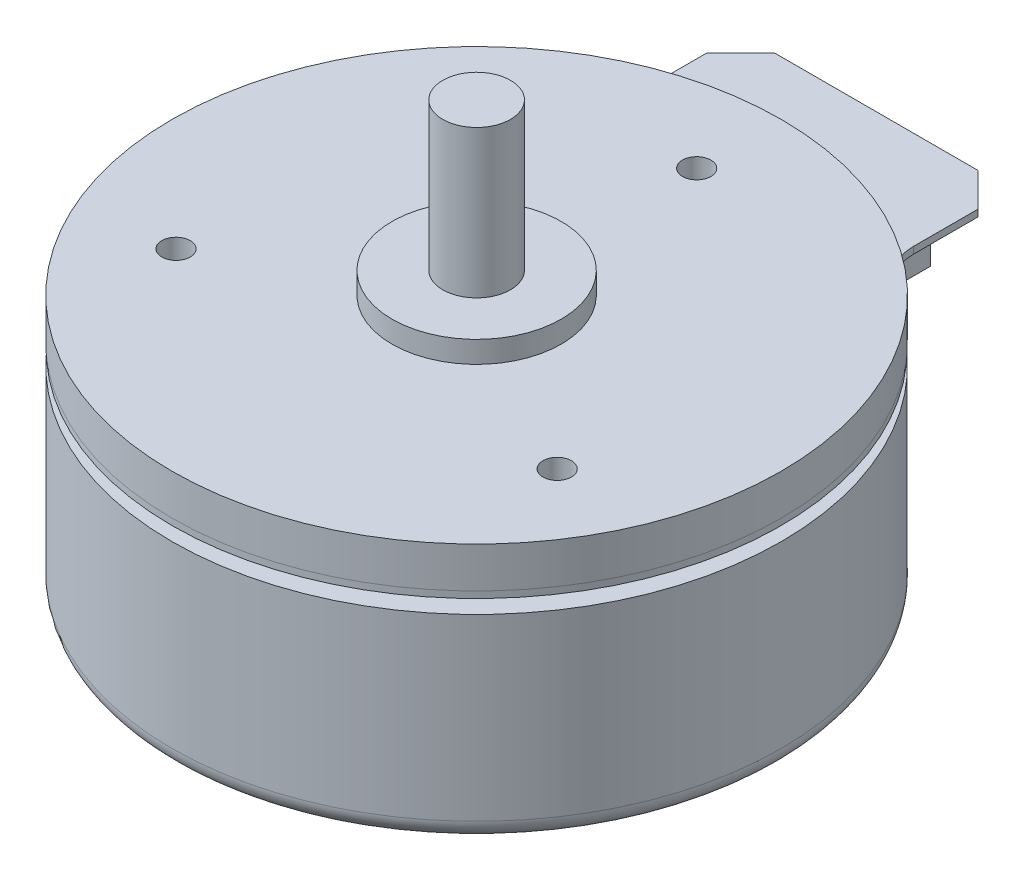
from build123d import *

# Parameters (mm, degrees)
SKETCH1_R                   = 45
BOSS_EXTRUDE1_DEPTH         = 6
SKETCH2_R                   = 12.5
BOSS_EXTRUDE2_DEPTH         = 3.2
SKETCH3_R                   = 5
BOSS_EXTRUDE3_DEPTH         = 25
TAP_DRILL_FOR_M5_TAP1_D     = 4.2
TAP_DRILL_FOR_M5_TAP1_DEPTH = 4.5381927
TAP_DRILL_FOR_M5_TAP1_TIP   = 1.2618073
BOSS_EXTRUDE4_DEPTH         = 1
SKETCH8_R                   = 40
BOSS_EXTRUDE5_DEPTH         = 2
BOSS_EXTRUDE6_START         = 29.464
SKETCH9_R                   = 45
BOSS_EXTRUDE6_DEPTH         = 29.464
FILLET1_R                   = 3
SKETCH11_W                  = 20
SKETCH11_H                  = 10
BOSS_EXTRUDE7_DEPTH         = 13.8


with BuildPart() as part:
    # Sketch1 → Boss-Extrude1 (new body)
    with BuildSketch(Plane(origin=(0, 0, 0), x_dir=(1, 0, 0), z_dir=(0, 1, 0))):
        with Locations(Location((0, 0, 0), (0, 0, 270))):
            Circle(SKETCH1_R)
    extrude(amount=BOSS_EXTRUDE1_DEPTH)

    # Sketch2 → Boss-Extrude2 (add)
    with BuildSketch(Plane(origin=(0, 6, 0), x_dir=(1, 0, 0), z_dir=(0, 1, 0))):
        with Locations(Location((0, 0, 0), (0, 0, 270))):
            Circle(SKETCH2_R)
    extrude(amount=BOSS_EXTRUDE2_DEPTH)

    # Sketch3 → Boss-Extrude3 (add)
    with BuildSketch(Plane(origin=(0, 6, 0), x_dir=(1, 0, 0), z_dir=(0, 1, 0))):
        with Locations(Location((0, 0, 0), (0, 0, 270))):
            Circle(SKETCH3_R)
    extrude(amount=BOSS_EXTRUDE3_DEPTH)

    # Tap Drill for M5 Tap1
    with Locations(Plane(origin=(0, 6, -32.5), x_dir=(0, 0, 1), z_dir=(0, 1, 0))):
        with Locations((0, 0), (48.75, 28.145825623), (48.75, -28.145825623)):
            Hole(TAP_DRILL_FOR_M5_TAP1_D / 2, depth=TAP_DRILL_FOR_M5_TAP1_DEPTH)
            with Locations((0, 0, -(TAP_DRILL_FOR_M5_TAP1_DEPTH + TAP_DRILL_FOR_M5_TAP1_TIP / 2))):  # 118° drill point
                Cone(0, TAP_DRILL_FOR_M5_TAP1_D / 2, TAP_DRILL_FOR_M5_TAP1_TIP, mode=Mode.SUBTRACT)

    # Sketch7 → Boss-Extrude4 (add)
    with BuildSketch(Plane.XZ):
        with BuildLine():
            Line((20, -44.522775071), (20, -54.050252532))
            Line((20, -54.050252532), (15.050252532, -59))
            Line((15.050252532, -59), (-15.050252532, -59))
            Line((-15.050252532, -59), (-20, -54.050252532))
            Line((-20, -54.050252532), (-20, -44.522775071))
            ThreePointArc((-20, -44.522775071), (-20.925376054, -40.978535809), (-23.465277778, -38.339056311))
            ThreePointArc((-23.465277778, -38.339056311), (0, 44.95), (23.465277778, -38.339056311))
            ThreePointArc((23.465277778, -38.339056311), (20.925376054, -40.978535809), (20, -44.522775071))
        make_face()
    extrude(amount=BOSS_EXTRUDE4_DEPTH)

    # Sketch8 → Boss-Extrude5 (add)
    with BuildSketch(Plane.XZ.offset(1)):
        with Locations(Location((0, 0, 0), (0, 0, 270))):
            Circle(SKETCH8_R)
    extrude(amount=BOSS_EXTRUDE5_DEPTH)

    # Sketch9 → Boss-Extrude6 (add)
    with BuildSketch(Plane.XZ.offset(3).offset(BOSS_EXTRUDE6_START)):
        with Locations(Location((0, 0, 0), (0, 0, 300.463702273))):
            Circle(SKETCH9_R)
    extrude(amount=-BOSS_EXTRUDE6_DEPTH)

    # Fillet1
    fillet1_edges = [part.edges().sort_by_distance(p)[0] for p in [
        (-22.814658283, -32.464, 38.787773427),
    ]]
    fillet(fillet1_edges, radius=FILLET1_R)

    # Sketch11 → Boss-Extrude7 (add)
    with BuildSketch(Plane(origin=(0, 0, 0), x_dir=(1, 0, 0), z_dir=(0, 1, 0))):
        with Locations((0, 52)):
            Rectangle(SKETCH11_W, SKETCH11_H)
    extrude(amount=-BOSS_EXTRUDE7_DEPTH)


solid = part.part
